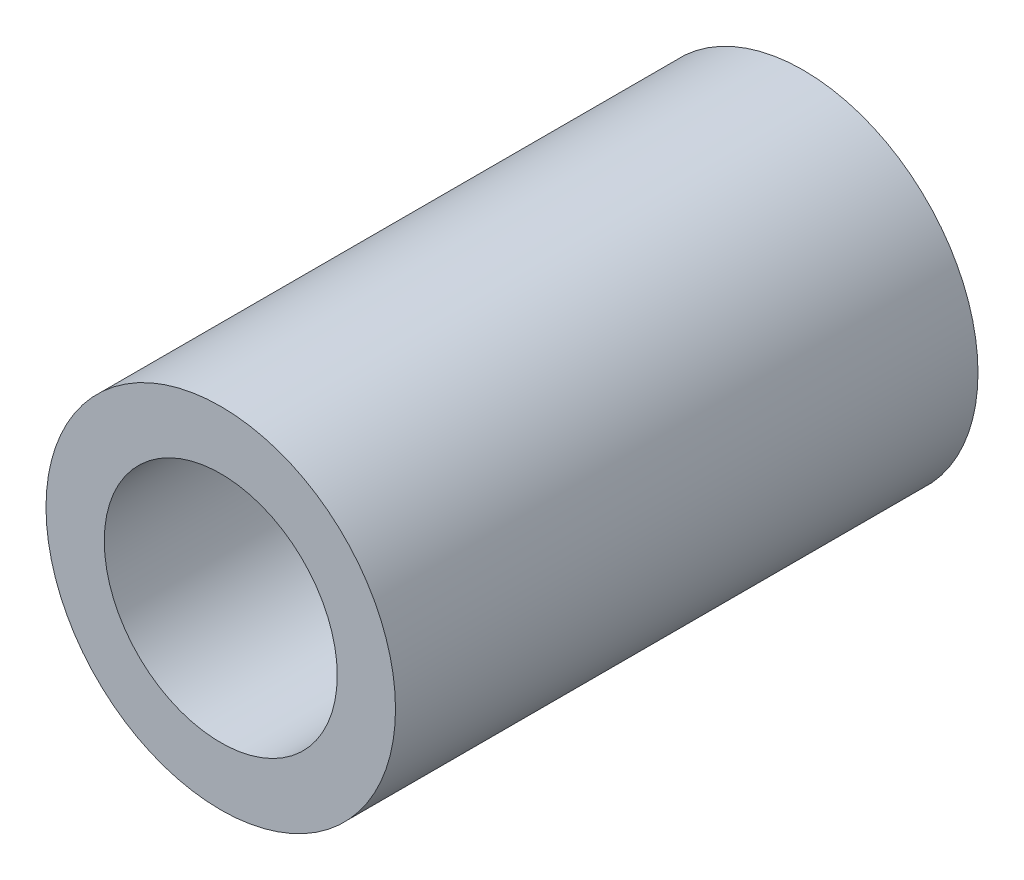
from build123d import *

# Parameters (mm, degrees)
ESQUISSE1_R      = 3
ESQUISSE1_R_2    = 2
EXTRUSION1_DEPTH = 10


with BuildPart() as part:
    # Esquisse1 → Extrusion1 (new body)
    with BuildSketch(Plane.XY):
        Circle(ESQUISSE1_R)
        Circle(ESQUISSE1_R_2, mode=Mode.SUBTRACT)
    extrude(amount=EXTRUSION1_DEPTH)


solid = part.part
